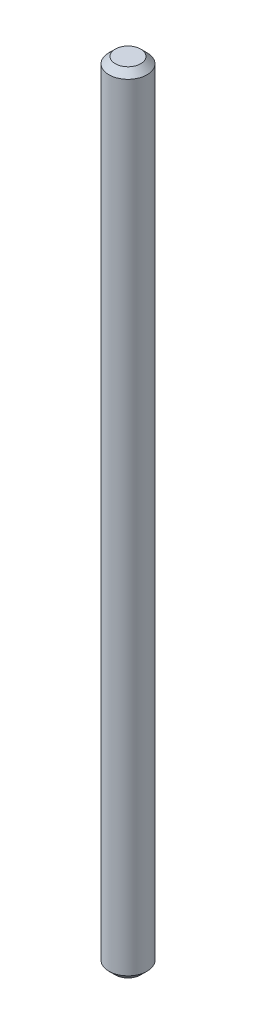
ISO-10303-21;
HEADER;
FILE_DESCRIPTION(('STEP AP214'),'2;1');
FILE_NAME('part.step','',(''),(''),'','','');
FILE_SCHEMA(('AUTOMOTIVE_DESIGN { 1 0 10303 214 1 1 1 1 }'));
ENDSEC;
DATA;
#1=APPLICATION_CONTEXT('core data for automotive mechanical design processes');
#2=APPLICATION_PROTOCOL_DEFINITION('international standard','automotive_design',2000,#1);
#3=PRODUCT_CONTEXT('',#1,'mechanical');
#4=PRODUCT('Part','Part','',(#3));
#5=PRODUCT_RELATED_PRODUCT_CATEGORY('part','',(#4));
#6=PRODUCT_DEFINITION_FORMATION('','',#4);
#7=PRODUCT_DEFINITION_CONTEXT('part definition',#1,'design');
#8=PRODUCT_DEFINITION('design','',#6,#7);
#9=PRODUCT_DEFINITION_SHAPE('','',#8);
#10=(LENGTH_UNIT() NAMED_UNIT(*) SI_UNIT(.MILLI.,.METRE.));
#11=(NAMED_UNIT(*) PLANE_ANGLE_UNIT() SI_UNIT($,.RADIAN.));
#12=(NAMED_UNIT(*) SI_UNIT($,.STERADIAN.) SOLID_ANGLE_UNIT());
#13=UNCERTAINTY_MEASURE_WITH_UNIT(LENGTH_MEASURE(1.E-05),#10,'distance_accuracy_value','');
#14=(GEOMETRIC_REPRESENTATION_CONTEXT(3) GLOBAL_UNCERTAINTY_ASSIGNED_CONTEXT((#13)) GLOBAL_UNIT_ASSIGNED_CONTEXT((#10,
#11,#12)) REPRESENTATION_CONTEXT('',''));
#15=CARTESIAN_POINT('',(0.,0.,0.));
#16=DIRECTION('',(0.,0.,1.));
#17=DIRECTION('',(1.,0.,0.));
#18=AXIS2_PLACEMENT_3D('',#15,#16,#17);
#19=CARTESIAN_POINT('',(0.,62.,0.));
#20=DIRECTION('',(0.,-1.,0.));
#21=DIRECTION('',(0.,0.,-1.));
#22=AXIS2_PLACEMENT_3D('',#19,#20,#21);
#23=CYLINDRICAL_SURFACE('',#22,1.5);
#24=CARTESIAN_POINT('',(0.,0.5,0.));
#25=DIRECTION('',(0.,1.,0.));
#26=DIRECTION('',(0.,0.,1.));
#27=AXIS2_PLACEMENT_3D('',#24,#25,#26);
#28=CIRCLE('',#27,1.5);
#29=CARTESIAN_POINT('',(0.,0.5,1.5));
#30=VERTEX_POINT('',#29);
#31=EDGE_CURVE('E42',#30,#30,#28,.T.);
#32=ORIENTED_EDGE('',*,*,#31,.T.);
#33=EDGE_LOOP('',(#32));
#34=FACE_BOUND('',#33,.T.);
#35=CARTESIAN_POINT('',(0.,61.5,0.));
#36=DIRECTION('',(0.,1.,0.));
#37=DIRECTION('',(0.,0.,1.));
#38=AXIS2_PLACEMENT_3D('',#35,#36,#37);
#39=CIRCLE('',#38,1.5);
#40=CARTESIAN_POINT('',(0.,61.5,1.5));
#41=VERTEX_POINT('',#40);
#42=EDGE_CURVE('E46',#41,#41,#39,.F.);
#43=ORIENTED_EDGE('',*,*,#42,.T.);
#44=EDGE_LOOP('',(#43));
#45=FACE_BOUND('',#44,.T.);
#46=ADVANCED_FACE('F31',(#34,#45),#23,.T.);
#47=CARTESIAN_POINT('',(0.,62.,0.));
#48=DIRECTION('',(0.,1.,0.));
#49=DIRECTION('',(0.,0.,1.));
#50=AXIS2_PLACEMENT_3D('',#47,#48,#49);
#51=PLANE('',#50);
#52=CARTESIAN_POINT('',(0.,62.,0.));
#53=DIRECTION('',(0.,1.,0.));
#54=DIRECTION('',(0.,0.,1.));
#55=AXIS2_PLACEMENT_3D('',#52,#53,#54);
#56=CIRCLE('',#55,1.00000000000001);
#57=CARTESIAN_POINT('',(0.,62.,1.00000000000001));
#58=VERTEX_POINT('',#57);
#59=EDGE_CURVE('E10',#58,#58,#56,.T.);
#60=ORIENTED_EDGE('',*,*,#59,.T.);
#61=EDGE_LOOP('',(#60));
#62=FACE_BOUND('',#61,.T.);
#63=ADVANCED_FACE('F62',(#62),#51,.T.);
#64=CARTESIAN_POINT('',(0.,0.,0.));
#65=DIRECTION('',(0.,1.,0.));
#66=DIRECTION('',(0.,0.,1.));
#67=AXIS2_PLACEMENT_3D('',#64,#65,#66);
#68=PLANE('',#67);
#69=CARTESIAN_POINT('',(0.,0.,0.));
#70=DIRECTION('',(0.,1.,0.));
#71=DIRECTION('',(0.,0.,1.));
#72=AXIS2_PLACEMENT_3D('',#69,#70,#71);
#73=CIRCLE('',#72,1.);
#74=CARTESIAN_POINT('',(0.,0.,1.));
#75=VERTEX_POINT('',#74);
#76=EDGE_CURVE('E38',#75,#75,#73,.F.);
#77=ORIENTED_EDGE('',*,*,#76,.T.);
#78=EDGE_LOOP('',(#77));
#79=FACE_BOUND('',#78,.T.);
#80=ADVANCED_FACE('F59',(#79),#68,.F.);
#81=CARTESIAN_POINT('',(0.,0.5,0.));
#82=DIRECTION('',(0.,1.,0.));
#83=DIRECTION('',(0.,0.,1.));
#84=AXIS2_PLACEMENT_3D('',#81,#82,#83);
#85=CONICAL_SURFACE('',#84,1.5,0.785398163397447);
#86=ORIENTED_EDGE('',*,*,#76,.F.);
#87=EDGE_LOOP('',(#86));
#88=FACE_BOUND('',#87,.T.);
#89=ORIENTED_EDGE('',*,*,#31,.F.);
#90=EDGE_LOOP('',(#89));
#91=FACE_BOUND('',#90,.T.);
#92=ADVANCED_FACE('F55',(#88,#91),#85,.T.);
#93=CARTESIAN_POINT('',(0.,62.,0.));
#94=DIRECTION('',(0.,-1.,0.));
#95=DIRECTION('',(0.,0.,-1.));
#96=AXIS2_PLACEMENT_3D('',#93,#94,#95);
#97=CONICAL_SURFACE('',#96,1.00000000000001,0.785398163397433);
#98=ORIENTED_EDGE('',*,*,#42,.F.);
#99=EDGE_LOOP('',(#98));
#100=FACE_BOUND('',#99,.T.);
#101=ORIENTED_EDGE('',*,*,#59,.F.);
#102=EDGE_LOOP('',(#101));
#103=FACE_BOUND('',#102,.T.);
#104=ADVANCED_FACE('F33',(#100,#103),#97,.T.);
#105=CLOSED_SHELL('',(#46,#63,#80,#92,#104));
#106=MANIFOLD_SOLID_BREP('B2',#105);
#107=ADVANCED_BREP_SHAPE_REPRESENTATION('',(#18,#106),#14);
#108=SHAPE_DEFINITION_REPRESENTATION(#9,#107);
ENDSEC;
END-ISO-10303-21;
